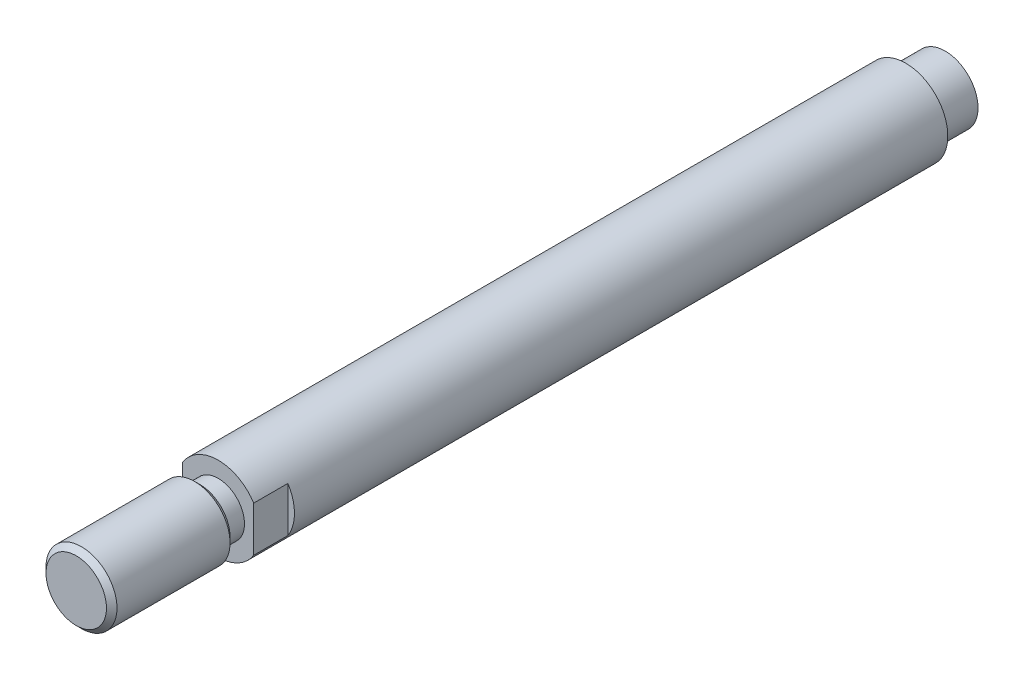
from build123d import *

# Parameters (mm, degrees)
CHANFREIN1_SIZE              = 2
ENL_V_MAT_EXTRU_1_DEPTH      = 332.273678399
ENL_V_MAT_EXTRU_1_DEPTH_BACK = 332.273678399
ESQUISSE2_W                  = 2.5
ESQUISSE2_H                  = 13


with BuildPart() as part:
    # Esquisse1 → Base-R_volution (revolve)
    with BuildSketch(Plane(origin=(0, 0, 0), x_dir=(0, 0, -1), z_dir=(1, 0, 0)), mode=Mode.PRIVATE) as base_r_volution_sk:
        Polygon((-15, 16), (-15, 12.5), (0, 12.5), (0, 0), (-330.5, 0), (-330.5, 13.5), (-283.5, 13.5), (-283.5, 10), (-276.5, 10), (-276.5, 16), align=None)
    revolve(base_r_volution_sk.sketch.rotate(Axis((0, 0, -6.243003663), (0, 0, 1)), 90), axis=Axis((0, 0, -6.243003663), (0, 0, 1)))

    # Chanfrein1
    chanfrein1_edges = [part.edges().sort_by_distance(p)[0] for p in [
        (13.5, 0, 330.5),
        (13.5, 0, 283.5),
    ]]
    chamfer(chanfrein1_edges, length=CHANFREIN1_SIZE)

    # Esquisse2 → Enl_v. mat.-Extru.1 (cut, two sides: drawn at the far end of the back side and taken through both)
    with BuildSketch(Plane(origin=(0, 0, 0), x_dir=(1, 0, 0), z_dir=(0, 1, 0)).offset(-ENL_V_MAT_EXTRU_1_DEPTH_BACK)):
        with Locations((-14.75, -270)):
            Rectangle(ESQUISSE2_W, ESQUISSE2_H)
        with Locations((14.75, -270)):
            Rectangle(ESQUISSE2_W, ESQUISSE2_H)
    extrude(amount=ENL_V_MAT_EXTRU_1_DEPTH + ENL_V_MAT_EXTRU_1_DEPTH_BACK, mode=Mode.SUBTRACT)


solid = part.part
